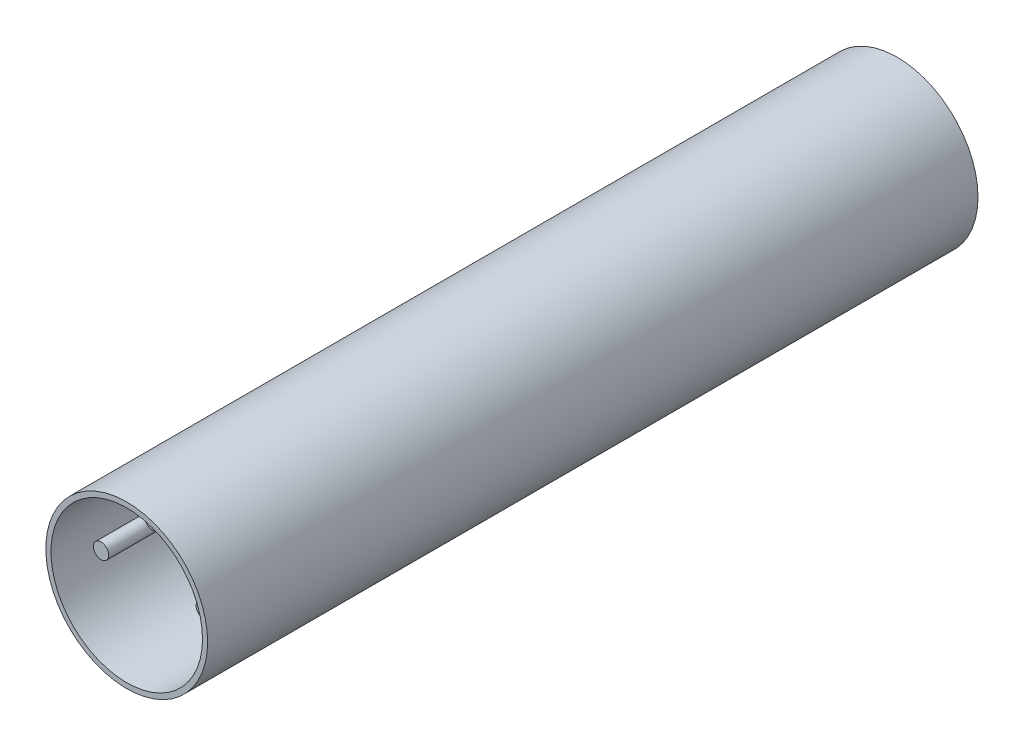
ISO-10303-21;
HEADER;
FILE_DESCRIPTION(('STEP AP214'),'2;1');
FILE_NAME('part.step','',(''),(''),'','','');
FILE_SCHEMA(('AUTOMOTIVE_DESIGN { 1 0 10303 214 1 1 1 1 }'));
ENDSEC;
DATA;
#1=APPLICATION_CONTEXT('core data for automotive mechanical design processes');
#2=APPLICATION_PROTOCOL_DEFINITION('international standard','automotive_design',2000,#1);
#3=PRODUCT_CONTEXT('',#1,'mechanical');
#4=PRODUCT('Part','Part','',(#3));
#5=PRODUCT_RELATED_PRODUCT_CATEGORY('part','',(#4));
#6=PRODUCT_DEFINITION_FORMATION('','',#4);
#7=PRODUCT_DEFINITION_CONTEXT('part definition',#1,'design');
#8=PRODUCT_DEFINITION('design','',#6,#7);
#9=PRODUCT_DEFINITION_SHAPE('','',#8);
#10=(LENGTH_UNIT() NAMED_UNIT(*) SI_UNIT(.MILLI.,.METRE.));
#11=(NAMED_UNIT(*) PLANE_ANGLE_UNIT() SI_UNIT($,.RADIAN.));
#12=(NAMED_UNIT(*) SI_UNIT($,.STERADIAN.) SOLID_ANGLE_UNIT());
#13=UNCERTAINTY_MEASURE_WITH_UNIT(LENGTH_MEASURE(1.E-05),#10,'distance_accuracy_value','');
#14=(GEOMETRIC_REPRESENTATION_CONTEXT(3) GLOBAL_UNCERTAINTY_ASSIGNED_CONTEXT((#13)) GLOBAL_UNIT_ASSIGNED_CONTEXT((#10,
#11,#12)) REPRESENTATION_CONTEXT('',''));
#15=CARTESIAN_POINT('',(0.,0.,0.));
#16=DIRECTION('',(0.,0.,1.));
#17=DIRECTION('',(1.,0.,0.));
#18=AXIS2_PLACEMENT_3D('',#15,#16,#17);
#19=CARTESIAN_POINT('',(-2.54,0.,-1.27));
#20=DIRECTION('',(0.,0.,-1.));
#21=DIRECTION('',(-1.,0.,0.));
#22=AXIS2_PLACEMENT_3D('',#19,#20,#21);
#23=CYLINDRICAL_SURFACE('',#22,0.381);
#24=CARTESIAN_POINT('',(-2.54,0.,-1.27));
#25=DIRECTION('',(0.,0.,1.));
#26=DIRECTION('',(-1.,0.,0.));
#27=AXIS2_PLACEMENT_3D('',#24,#25,#26);
#28=CIRCLE('',#27,0.381);
#29=CARTESIAN_POINT('',(-2.921,0.,-1.27));
#30=VERTEX_POINT('',#29);
#31=EDGE_CURVE('E11',#30,#30,#28,.T.);
#32=ORIENTED_EDGE('',*,*,#31,.F.);
#33=EDGE_LOOP('',(#32));
#34=FACE_BOUND('',#33,.T.);
#35=CARTESIAN_POINT('',(-2.54,0.,-6.35));
#36=DIRECTION('',(0.,0.,1.));
#37=DIRECTION('',(-1.,0.,0.));
#38=AXIS2_PLACEMENT_3D('',#35,#36,#37);
#39=CIRCLE('',#38,0.381);
#40=CARTESIAN_POINT('',(-2.921,0.,-6.35));
#41=VERTEX_POINT('',#40);
#42=EDGE_CURVE('E43',#41,#41,#39,.T.);
#43=ORIENTED_EDGE('',*,*,#42,.T.);
#44=EDGE_LOOP('',(#43));
#45=FACE_BOUND('',#44,.T.);
#46=ADVANCED_FACE('F40',(#34,#45),#23,.T.);
#47=CARTESIAN_POINT('',(-2.54,0.,-1.27));
#48=DIRECTION('',(0.,0.,-1.));
#49=DIRECTION('',(-1.,0.,0.));
#50=AXIS2_PLACEMENT_3D('',#47,#48,#49);
#51=PLANE('',#50);
#52=ORIENTED_EDGE('',*,*,#31,.T.);
#53=EDGE_LOOP('',(#52));
#54=FACE_BOUND('',#53,.T.);
#55=ADVANCED_FACE('F55',(#54),#51,.F.);
#56=CARTESIAN_POINT('',(-2.54,0.,-6.35));
#57=DIRECTION('',(0.,0.,-1.));
#58=DIRECTION('',(-1.,0.,0.));
#59=AXIS2_PLACEMENT_3D('',#56,#57,#58);
#60=PLANE('',#59);
#61=ORIENTED_EDGE('',*,*,#42,.F.);
#62=EDGE_LOOP('',(#61));
#63=FACE_BOUND('',#62,.T.);
#64=ADVANCED_FACE('F53',(#63),#60,.T.);
#65=CLOSED_SHELL('',(#46,#55,#64));
#66=MANIFOLD_SOLID_BREP('B2',#65);
#67=CARTESIAN_POINT('',(2.54,0.,-1.27));
#68=DIRECTION('',(0.,0.,-1.));
#69=DIRECTION('',(-1.,0.,0.));
#70=AXIS2_PLACEMENT_3D('',#67,#68,#69);
#71=CYLINDRICAL_SURFACE('',#70,0.381);
#72=CARTESIAN_POINT('',(2.54,0.,-1.27));
#73=DIRECTION('',(0.,0.,1.));
#74=DIRECTION('',(1.,0.,0.));
#75=AXIS2_PLACEMENT_3D('',#72,#73,#74);
#76=CIRCLE('',#75,0.381);
#77=CARTESIAN_POINT('',(2.921,0.,-1.27));
#78=VERTEX_POINT('',#77);
#79=EDGE_CURVE('E39',#78,#78,#76,.T.);
#80=ORIENTED_EDGE('',*,*,#79,.F.);
#81=EDGE_LOOP('',(#80));
#82=FACE_BOUND('',#81,.T.);
#83=CARTESIAN_POINT('',(2.54,0.,-6.35));
#84=DIRECTION('',(0.,0.,1.));
#85=DIRECTION('',(1.,0.,0.));
#86=AXIS2_PLACEMENT_3D('',#83,#84,#85);
#87=CIRCLE('',#86,0.381);
#88=CARTESIAN_POINT('',(2.921,0.,-6.35));
#89=VERTEX_POINT('',#88);
#90=EDGE_CURVE('E92',#89,#89,#87,.T.);
#91=ORIENTED_EDGE('',*,*,#90,.T.);
#92=EDGE_LOOP('',(#91));
#93=FACE_BOUND('',#92,.T.);
#94=ADVANCED_FACE('F89',(#82,#93),#71,.T.);
#95=CARTESIAN_POINT('',(2.54,0.,-1.27));
#96=DIRECTION('',(0.,0.,1.));
#97=DIRECTION('',(1.,0.,0.));
#98=AXIS2_PLACEMENT_3D('',#95,#96,#97);
#99=PLANE('',#98);
#100=ORIENTED_EDGE('',*,*,#79,.T.);
#101=EDGE_LOOP('',(#100));
#102=FACE_BOUND('',#101,.T.);
#103=ADVANCED_FACE('F104',(#102),#99,.T.);
#104=CARTESIAN_POINT('',(2.54,0.,-6.35));
#105=DIRECTION('',(0.,0.,1.));
#106=DIRECTION('',(1.,0.,0.));
#107=AXIS2_PLACEMENT_3D('',#104,#105,#106);
#108=PLANE('',#107);
#109=ORIENTED_EDGE('',*,*,#90,.F.);
#110=EDGE_LOOP('',(#109));
#111=FACE_BOUND('',#110,.T.);
#112=ADVANCED_FACE('F102',(#111),#108,.F.);
#113=CLOSED_SHELL('',(#94,#103,#112));
#114=MANIFOLD_SOLID_BREP('B6',#113);
#115=CARTESIAN_POINT('',(0.,2.54,-1.27));
#116=DIRECTION('',(0.,0.,-1.));
#117=DIRECTION('',(-1.,0.,0.));
#118=AXIS2_PLACEMENT_3D('',#115,#116,#117);
#119=CYLINDRICAL_SURFACE('',#118,0.381);
#120=CARTESIAN_POINT('',(0.,2.54,-1.27));
#121=DIRECTION('',(0.,0.,1.));
#122=DIRECTION('',(1.,0.,0.));
#123=AXIS2_PLACEMENT_3D('',#120,#121,#122);
#124=CIRCLE('',#123,0.381);
#125=CARTESIAN_POINT('',(0.381,2.54,-1.27));
#126=VERTEX_POINT('',#125);
#127=EDGE_CURVE('E88',#126,#126,#124,.T.);
#128=ORIENTED_EDGE('',*,*,#127,.F.);
#129=EDGE_LOOP('',(#128));
#130=FACE_BOUND('',#129,.T.);
#131=CARTESIAN_POINT('',(0.,2.54,-6.35));
#132=DIRECTION('',(0.,0.,1.));
#133=DIRECTION('',(1.,0.,0.));
#134=AXIS2_PLACEMENT_3D('',#131,#132,#133);
#135=CIRCLE('',#134,0.381);
#136=CARTESIAN_POINT('',(0.381,2.54,-6.35));
#137=VERTEX_POINT('',#136);
#138=EDGE_CURVE('E140',#137,#137,#135,.T.);
#139=ORIENTED_EDGE('',*,*,#138,.T.);
#140=EDGE_LOOP('',(#139));
#141=FACE_BOUND('',#140,.T.);
#142=ADVANCED_FACE('F137',(#130,#141),#119,.T.);
#143=CARTESIAN_POINT('',(0.,2.54,-1.27));
#144=DIRECTION('',(0.,0.,1.));
#145=DIRECTION('',(1.,0.,0.));
#146=AXIS2_PLACEMENT_3D('',#143,#144,#145);
#147=PLANE('',#146);
#148=ORIENTED_EDGE('',*,*,#127,.T.);
#149=EDGE_LOOP('',(#148));
#150=FACE_BOUND('',#149,.T.);
#151=ADVANCED_FACE('F152',(#150),#147,.T.);
#152=CARTESIAN_POINT('',(0.,2.54,-6.35));
#153=DIRECTION('',(0.,0.,1.));
#154=DIRECTION('',(1.,0.,0.));
#155=AXIS2_PLACEMENT_3D('',#152,#153,#154);
#156=PLANE('',#155);
#157=ORIENTED_EDGE('',*,*,#138,.F.);
#158=EDGE_LOOP('',(#157));
#159=FACE_BOUND('',#158,.T.);
#160=ADVANCED_FACE('F150',(#159),#156,.F.);
#161=CLOSED_SHELL('',(#142,#151,#160));
#162=MANIFOLD_SOLID_BREP('B34',#161);
#163=CARTESIAN_POINT('',(0.,0.,-38.1));
#164=DIRECTION('',(0.,0.,1.));
#165=DIRECTION('',(1.,0.,0.));
#166=AXIS2_PLACEMENT_3D('',#163,#164,#165);
#167=CYLINDRICAL_SURFACE('',#166,4.0005);
#168=CARTESIAN_POINT('',(0.,0.,-38.1));
#169=DIRECTION('',(0.,0.,1.));
#170=DIRECTION('',(1.,0.,0.));
#171=AXIS2_PLACEMENT_3D('',#168,#169,#170);
#172=CIRCLE('',#171,4.0005);
#173=CARTESIAN_POINT('',(4.0005,0.,-38.1));
#174=VERTEX_POINT('',#173);
#175=EDGE_CURVE('E136',#174,#174,#172,.T.);
#176=CARTESIAN_POINT('',(0.,0.,0.));
#177=DIRECTION('',(0.,0.,1.));
#178=DIRECTION('',(1.,0.,0.));
#179=AXIS2_PLACEMENT_3D('',#176,#177,#178);
#180=CIRCLE('',#179,4.0005);
#181=CARTESIAN_POINT('',(4.0005,0.,0.));
#182=VERTEX_POINT('',#181);
#183=EDGE_CURVE('E181',#182,#182,#180,.T.);
#184=CARTESIAN_POINT('',(4.0005,0.,-38.1));
#185=CARTESIAN_POINT('',(4.0005,0.,-37.703125));
#186=CARTESIAN_POINT('',(4.0005,0.,-37.30625));
#187=CARTESIAN_POINT('',(4.0005,0.,-36.5125));
#188=CARTESIAN_POINT('',(4.0005,0.,-36.115625));
#189=CARTESIAN_POINT('',(4.0005,0.,-35.321875));
#190=CARTESIAN_POINT('',(4.0005,0.,-34.925));
#191=CARTESIAN_POINT('',(4.0005,0.,-34.13125));
#192=CARTESIAN_POINT('',(4.0005,0.,-33.734375));
#193=CARTESIAN_POINT('',(4.0005,0.,-32.940625));
#194=CARTESIAN_POINT('',(4.0005,0.,-32.54375));
#195=CARTESIAN_POINT('',(4.0005,0.,-31.75));
#196=CARTESIAN_POINT('',(4.0005,0.,-31.353125));
#197=CARTESIAN_POINT('',(4.0005,0.,-30.559375));
#198=CARTESIAN_POINT('',(4.0005,0.,-30.1625));
#199=CARTESIAN_POINT('',(4.0005,0.,-29.36875));
#200=CARTESIAN_POINT('',(4.0005,0.,-28.971875));
#201=CARTESIAN_POINT('',(4.0005,0.,-28.178125));
#202=CARTESIAN_POINT('',(4.0005,0.,-27.78125));
#203=CARTESIAN_POINT('',(4.0005,0.,-26.9875));
#204=CARTESIAN_POINT('',(4.0005,0.,-26.590625));
#205=CARTESIAN_POINT('',(4.0005,0.,-25.796875));
#206=CARTESIAN_POINT('',(4.0005,0.,-25.4));
#207=CARTESIAN_POINT('',(4.0005,0.,-24.60625));
#208=CARTESIAN_POINT('',(4.0005,0.,-24.209375));
#209=CARTESIAN_POINT('',(4.0005,0.,-23.415625));
#210=CARTESIAN_POINT('',(4.0005,0.,-23.01875));
#211=CARTESIAN_POINT('',(4.0005,0.,-22.225));
#212=CARTESIAN_POINT('',(4.0005,0.,-21.828125));
#213=CARTESIAN_POINT('',(4.0005,0.,-21.034375));
#214=CARTESIAN_POINT('',(4.0005,0.,-20.6375));
#215=CARTESIAN_POINT('',(4.0005,0.,-19.84375));
#216=CARTESIAN_POINT('',(4.0005,0.,-19.446875));
#217=CARTESIAN_POINT('',(4.0005,0.,-18.653125));
#218=CARTESIAN_POINT('',(4.0005,0.,-18.25625));
#219=CARTESIAN_POINT('',(4.0005,0.,-17.4625));
#220=CARTESIAN_POINT('',(4.0005,0.,-17.065625));
#221=CARTESIAN_POINT('',(4.0005,0.,-16.271875));
#222=CARTESIAN_POINT('',(4.0005,0.,-15.875));
#223=CARTESIAN_POINT('',(4.0005,0.,-15.08125));
#224=CARTESIAN_POINT('',(4.0005,0.,-14.684375));
#225=CARTESIAN_POINT('',(4.0005,0.,-13.890625));
#226=CARTESIAN_POINT('',(4.0005,0.,-13.49375));
#227=CARTESIAN_POINT('',(4.0005,0.,-12.7));
#228=CARTESIAN_POINT('',(4.0005,0.,-12.303125));
#229=CARTESIAN_POINT('',(4.0005,0.,-11.509375));
#230=CARTESIAN_POINT('',(4.0005,0.,-11.1125));
#231=CARTESIAN_POINT('',(4.0005,0.,-10.31875));
#232=CARTESIAN_POINT('',(4.0005,0.,-9.921875));
#233=CARTESIAN_POINT('',(4.0005,0.,-9.128125));
#234=CARTESIAN_POINT('',(4.0005,0.,-8.73125));
#235=CARTESIAN_POINT('',(4.0005,0.,-7.9375));
#236=CARTESIAN_POINT('',(4.0005,0.,-7.540625));
#237=CARTESIAN_POINT('',(4.0005,0.,-6.746875));
#238=CARTESIAN_POINT('',(4.0005,0.,-6.35));
#239=CARTESIAN_POINT('',(4.0005,0.,-5.55625));
#240=CARTESIAN_POINT('',(4.0005,0.,-5.159375));
#241=CARTESIAN_POINT('',(4.0005,0.,-4.365625));
#242=CARTESIAN_POINT('',(4.0005,0.,-3.96875));
#243=CARTESIAN_POINT('',(4.0005,0.,-3.175));
#244=CARTESIAN_POINT('',(4.0005,0.,-2.778125));
#245=CARTESIAN_POINT('',(4.0005,0.,-1.984375));
#246=CARTESIAN_POINT('',(4.0005,0.,-1.5875));
#247=CARTESIAN_POINT('',(4.0005,0.,-0.79375));
#248=CARTESIAN_POINT('',(4.0005,0.,-0.396875));
#249=CARTESIAN_POINT('',(4.0005,0.,0.));
#250=B_SPLINE_CURVE_WITH_KNOTS('',3,(#184,#185,#186,#187,#188,#189,#190,#191,#192,#193,#194,
#195,#196,#197,#198,#199,#200,#201,#202,#203,#204,#205,#206,#207,#208,#209,#210,#211,#212,#213,
#214,#215,#216,#217,#218,#219,#220,#221,#222,#223,#224,#225,#226,#227,#228,#229,#230,#231,#232,
#233,#234,#235,#236,#237,#238,#239,#240,#241,#242,#243,#244,#245,#246,#247,#248,#249),
.UNSPECIFIED.,.F.,.F.,(4,2,2,2,2,2,2,2,2,2,2,2,2,2,2,2,2,2,2,2,2,2,2,2,2,2,2,2,2,2,2,2,4),(0.,
1.19062499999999,2.38124999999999,3.571875,4.7625,5.953125,7.14375,8.334375,9.525,10.715625,
11.90625,13.096875,14.2875,15.478125,16.66875,17.859375,19.05,20.240625,21.43125,22.621875,
23.8125,25.003125,26.19375,27.384375,28.575,29.765625,30.95625,32.146875,33.3375,34.528125,
35.71875,36.909375,38.1),.UNSPECIFIED.);
#251=EDGE_CURVE('BSEAM178',#174,#182,#250,.T.);
#252=ORIENTED_EDGE('',*,*,#175,.T.);
#253=ORIENTED_EDGE('',*,*,#183,.F.);
#254=ORIENTED_EDGE('',*,*,#251,.T.);
#255=ORIENTED_EDGE('',*,*,#251,.F.);
#256=EDGE_LOOP('',(#252,#254,#253,#255));
#257=FACE_BOUND('',#256,.T.);
#258=ADVANCED_FACE('F178',(#257),#167,.T.);
#259=CARTESIAN_POINT('',(0.,0.,-38.1));
#260=DIRECTION('',(0.,0.,1.));
#261=DIRECTION('',(1.,0.,0.));
#262=AXIS2_PLACEMENT_3D('',#259,#260,#261);
#263=PLANE('',#262);
#264=ORIENTED_EDGE('',*,*,#175,.F.);
#265=EDGE_LOOP('',(#264));
#266=FACE_BOUND('',#265,.T.);
#267=ADVANCED_FACE('F207',(#266),#263,.F.);
#268=CARTESIAN_POINT('',(0.,0.,0.));
#269=DIRECTION('',(0.,0.,1.));
#270=DIRECTION('',(1.,0.,0.));
#271=AXIS2_PLACEMENT_3D('',#268,#269,#270);
#272=PLANE('',#271);
#273=CARTESIAN_POINT('',(0.,0.,0.));
#274=DIRECTION('',(0.,0.,1.));
#275=DIRECTION('',(1.,0.,0.));
#276=AXIS2_PLACEMENT_3D('',#273,#274,#275);
#277=CIRCLE('',#276,3.7465);
#278=CARTESIAN_POINT('',(3.7465,0.,0.));
#279=VERTEX_POINT('',#278);
#280=EDGE_CURVE('E190',#279,#279,#277,.T.);
#281=ORIENTED_EDGE('',*,*,#280,.F.);
#282=EDGE_LOOP('',(#281));
#283=FACE_BOUND('',#282,.T.);
#284=ORIENTED_EDGE('',*,*,#183,.T.);
#285=EDGE_LOOP('',(#284));
#286=FACE_BOUND('',#285,.T.);
#287=ADVANCED_FACE('F201',(#283,#286),#272,.T.);
#288=CARTESIAN_POINT('',(0.,0.,-6.35));
#289=DIRECTION('',(0.,0.,1.));
#290=DIRECTION('',(1.,0.,0.));
#291=AXIS2_PLACEMENT_3D('',#288,#289,#290);
#292=CYLINDRICAL_SURFACE('',#291,3.7465);
#293=CARTESIAN_POINT('',(0.,0.,-6.35));
#294=DIRECTION('',(0.,0.,1.));
#295=DIRECTION('',(1.,0.,0.));
#296=AXIS2_PLACEMENT_3D('',#293,#294,#295);
#297=CIRCLE('',#296,3.7465);
#298=CARTESIAN_POINT('',(3.7465,0.,-6.35));
#299=VERTEX_POINT('',#298);
#300=EDGE_CURVE('E188',#299,#299,#297,.T.);
#301=ORIENTED_EDGE('',*,*,#300,.F.);
#302=EDGE_LOOP('',(#301));
#303=FACE_BOUND('',#302,.T.);
#304=ORIENTED_EDGE('',*,*,#280,.T.);
#305=EDGE_LOOP('',(#304));
#306=FACE_BOUND('',#305,.T.);
#307=ADVANCED_FACE('F198',(#303,#306),#292,.F.);
#308=CARTESIAN_POINT('',(0.,0.,-6.35));
#309=DIRECTION('',(0.,0.,1.));
#310=DIRECTION('',(1.,0.,0.));
#311=AXIS2_PLACEMENT_3D('',#308,#309,#310);
#312=PLANE('',#311);
#313=ORIENTED_EDGE('',*,*,#300,.T.);
#314=EDGE_LOOP('',(#313));
#315=FACE_BOUND('',#314,.T.);
#316=ADVANCED_FACE('F196',(#315),#312,.T.);
#317=CLOSED_SHELL('',(#258,#267,#287,#307,#316));
#318=MANIFOLD_SOLID_BREP('B83',#317);
#319=ADVANCED_BREP_SHAPE_REPRESENTATION('',(#18,#66,#114,#162,#318),#14);
#320=SHAPE_DEFINITION_REPRESENTATION(#9,#319);
ENDSEC;
END-ISO-10303-21;
